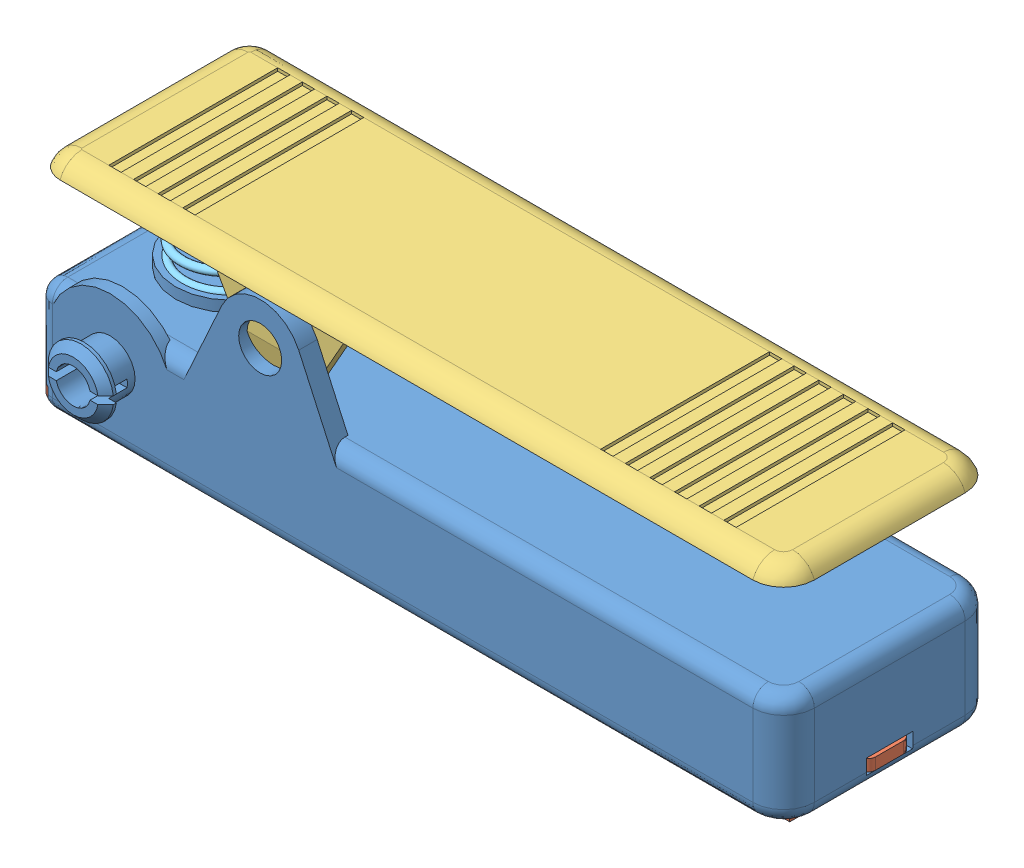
SolidWorks assembly Sub-assembly.SLDASM, configuration Default (file format 3100). Lengths in mm.
Overall size (123.19 37.06 41.15).
8 component instances, 5 part files, 19 mates.
Components (placement in the parent):
- Base-1: Base.SLDPRT [Default] x (1 0 0) z (0 0 -1) size (123.19 33.98 41.15)
- Cover-1: Cover.SLDPRT [Default] at (0 -16.51 32.4358) x (-1 0 0) z (0 0 1) size (123.14 3.94 34.73)
- Clamp-1: Clamp.SLDPRT [Default] at (0 15.7734 35.052) size (123.19 17.04 35.05)
- battery-1: battery.SLDPRT [Default] at (115.951 -10.287 25.146) x (-1 0 0) z (0 0 1) size (49.71 14.48 14.22)
- battery-3: battery.SLDPRT [Default] at (68.7832 -10.287 9.906) x (1 0 0) z (0 0 -1) size (49.71 14.48 14.22)
- battery-4: battery.SLDPRT [Default] at (19.0754 -10.287 9.906) x (1 0 0) z (0 0 -1) size (49.71 14.48 14.22)
- battery-2: battery.SLDPRT [Default] at (66.2432 -10.287 25.146) x (-1 0 0) z (0 0 1) size (49.71 14.48 14.22)
- Spring-1: Spring.SLDPRT [Default] at (14.605 15.14 17.526) x (1 0 0) z (0 1 0) size (16.54 16.51 17.05)
Mates (geometry in assembly coordinates):
- Coincident4: coincident aligned: plane of Base-1; plane of Cover-1
- Coincident5: coincident aligned: plane of Base-1; plane of Cover-1
- Coincident6: coincident: line of Base-1; plane of Cover-1
- Concentric3: concentric anti-aligned: cylinder of Base-1; cylinder of Clamp-1
- Coincident10: coincident anti-aligned: plane of Base-1; plane of Clamp-1
- Tangent3: tangent anti-aligned: plane of Base-1; cylinder of battery-3
- Parallel1: parallel aligned: plane of Base-1; plane of battery-3
- Distance1: distance = 3.175 mm anti-aligned: plane of Base-1; plane of battery-3
- Parallel4: parallel aligned: plane of Base-1; plane of battery-1
- Coincident15: coincident aligned: plane of battery-1; plane of battery-3
- Tangent7: tangent anti-aligned: plane of Base-1; cylinder of battery-1
- Coincident16: coincident: axis of battery-1; plane of battery-3
- Coincident17: coincident anti-aligned: plane of Base-1; plane of assembly
- Coincident18: coincident anti-aligned: plane of Base-1; plane of assembly
- Coincident19: coincident aligned: plane of Base-1; plane of assembly
- Coincident20: coincident anti-aligned: axis of Base-1; line of Spring-1
- Coincident21: coincident aligned: plane of Base-1; plane of Spring-1
- Parallel5: parallel anti-aligned: plane of Base-1; plane of Clamp-1
- Tangent8: tangent anti-aligned: 
